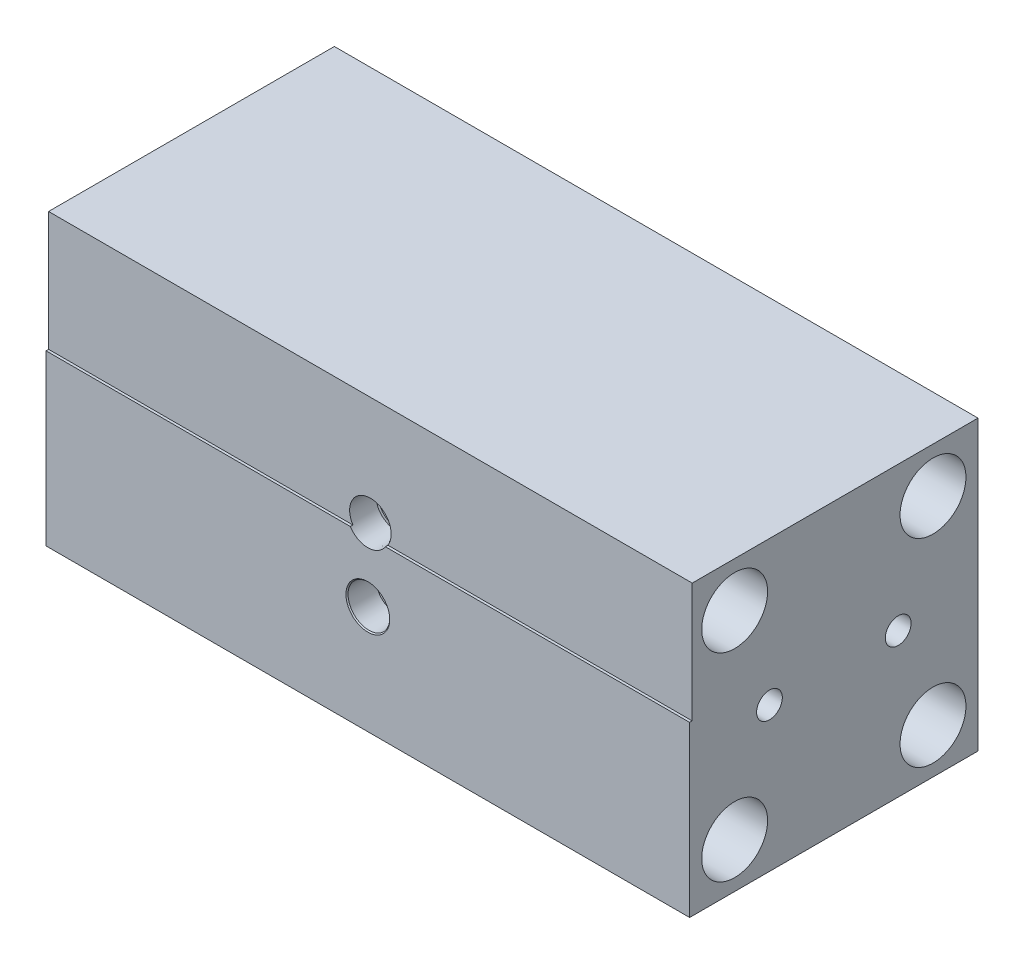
from build123d import *
from OCP.BRepFilletAPI import BRepFilletAPI_MakeChamfer

# Parameters (mm, degrees)
SKETCH1_W                         = 158.75
SKETCH1_H                         = 71.12
EXTRUDE1_DEPTH                    = 35.56
SKETCH18_W                        = 0.635
SKETCH18_H                        = 29.4386
CUT_EXTRUDE1_DEPTH                = 167.525042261
F_1_4_20_TAPPED_HOLE1_D           = 5.1054
F_1_4_20_TAPPED_HOLE1_DEPTH       = 14.3002
F_1_4_20_TAPPED_HOLE1_TIP         = 1.533816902
HOLE1_D                           = 6.35
HOLE1_DEPTH                       = 6.35
HOLE1_TIP                         = 1.907732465
F_1_8_NPT_TAPPED_HOLE1_AT_2_COUNT = 2
F_1_8_NPT_TAPPED_HOLE1_AT_2_PITCH = 17.78
F_1_4_20_TAPPED_HOLE2_D           = 5.1054
F_1_4_20_TAPPED_HOLE2_DEPTH       = 15.875
F_1_4_20_TAPPED_HOLE2_TIP         = 1.533816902
HOLE2_D                           = 6.35
HOLE2_DEPTH                       = 6.35
HOLE2_TIP                         = 1.907732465
SKETCH29_R                        = 8.128
SKETCH29_R_2                      = 3.175
CUT_EXTRUDE2_DEPTH                = 167.525042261
CHAMFER1_SIZE                     = 0.254
CHAMFER1_SIZE2                    = 0.261957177


with BuildPart() as part:
    # Sketch1 → Extrude1 (new, symmetric)
    with BuildSketch(Plane.XY):
        Rectangle(SKETCH1_W, SKETCH1_H)
    extrude(amount=EXTRUDE1_DEPTH, both=True)

    # Sketch18 → Cut-Extrude1 (cut, through all)
    with BuildSketch(Plane(origin=(79.375, 0, 0), x_dir=(0, 0, -1), z_dir=(1, 0, 0))):
        with Locations((-35.2425, 20.8407)):
            Rectangle(SKETCH18_W, SKETCH18_H)
    extrude(amount=-CUT_EXTRUDE1_DEPTH, mode=Mode.SUBTRACT)

    # 1_4-20 Tapped Hole1
    with Locations(Plane(origin=(0.538859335, -35.56, 6.981360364), x_dir=(1, 0, 0), z_dir=(0, -1, 0))):
        with Locations((-57.688859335, -6.981360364), (56.611140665, -6.981360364), (-19.588859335, -6.981360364), (18.511140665, -6.981360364)):
            Hole(F_1_4_20_TAPPED_HOLE1_D / 2, depth=F_1_4_20_TAPPED_HOLE1_DEPTH)
            with Locations((0, 0, -(F_1_4_20_TAPPED_HOLE1_DEPTH + F_1_4_20_TAPPED_HOLE1_TIP / 2))):  # 118° drill point
                Cone(0, F_1_4_20_TAPPED_HOLE1_D / 2, F_1_4_20_TAPPED_HOLE1_TIP, mode=Mode.SUBTRACT)

    # Hole1
    with Locations(Plane(origin=(-46.133592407, -35.56, -8.969374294), x_dir=(1, 0, 0), z_dir=(0, -1, 0))):
        with Locations((8.033592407, 8.969374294), (84.233592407, 8.969374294)):
            Hole(HOLE1_D / 2, depth=HOLE1_DEPTH)
            with Locations((0, 0, -(HOLE1_DEPTH + HOLE1_TIP / 2))):  # 118° drill point
                Cone(0, HOLE1_D / 2, HOLE1_TIP, mode=Mode.SUBTRACT)

    # Sketch23 → 1_8 NPT Tapped Hole1 (revolve, cut)
    with BuildSketch(Plane(origin=(0, -8.89, 35.56), x_dir=(0, -1, 0), z_dir=(1, 0, 0))):
        Polygon((0, 0), (0, 14.166668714), (4.2164, 11.6332), (4.2164, 6.9342), (4.936185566, 6.9342), (5.1438048, 0), align=None)
    f_1_8_npt_tapped_hole1 = revolve(axis=Axis((0, -8.89, 41.91), (0, 0, -1)), mode=Mode.SUBTRACT)

    # 1_8 NPT Tapped Hole1 at 2: 1_8 NPT Tapped Hole1 ×2
    with Locations(*[(0, i * F_1_8_NPT_TAPPED_HOLE1_AT_2_PITCH, 0) for i in range(1, F_1_8_NPT_TAPPED_HOLE1_AT_2_COUNT)]):
        add(f_1_8_npt_tapped_hole1, mode=Mode.SUBTRACT)

    # 1_4-20 Tapped Hole2
    with Locations(Plane(origin=(0, 0, -35.56), x_dir=(-1, 0, 0), z_dir=(0, 0, -1))):
        with Locations((-63.5, 10.16), (63.5, 10.16), (-63.5, -10.16), (63.5, -10.16)):
            Hole(F_1_4_20_TAPPED_HOLE2_D / 2, depth=F_1_4_20_TAPPED_HOLE2_DEPTH)
            with Locations((0, 0, -(F_1_4_20_TAPPED_HOLE2_DEPTH + F_1_4_20_TAPPED_HOLE2_TIP / 2))):  # 118° drill point
                Cone(0, F_1_4_20_TAPPED_HOLE2_D / 2, F_1_4_20_TAPPED_HOLE2_TIP, mode=Mode.SUBTRACT)

    # Hole2
    with Locations(Plane(origin=(0, 0, -35.56), x_dir=(-1, 0, 0), z_dir=(0, 0, -1))):
        with Locations((50.8, 10.16), (-50.8, -10.16)):
            Hole(HOLE2_D / 2, depth=HOLE2_DEPTH)
            with Locations((0, 0, -(HOLE2_DEPTH + HOLE2_TIP / 2))):  # 118° drill point
                Cone(0, HOLE2_D / 2, HOLE2_TIP, mode=Mode.SUBTRACT)

    # Sketch29 → Cut-Extrude2 (cut, through all)
    with BuildSketch(Plane(origin=(79.375, 0, 0), x_dir=(0, 0, -1), z_dir=(1, 0, 0))):
        with Locations((-24.4602, 24.4602)):
            Circle(SKETCH29_R)
        with Locations((24.4602, 24.4602)):
            Circle(SKETCH29_R)
        with Locations((-24.4602, -24.4602)):
            Circle(SKETCH29_R)
        with Locations((24.4602, -24.4602)):
            Circle(SKETCH29_R)
        with Locations((-15.875, 0)):
            Circle(SKETCH29_R_2)
        with Locations((15.875, 0)):
            Circle(SKETCH29_R_2)
    extrude(amount=-CUT_EXTRUDE2_DEPTH, mode=Mode.SUBTRACT)

    # Chamfer1: one chamfer whose edges measure the first distance from different faces: ONE call of the kernel's chamfer builder (chamfer() names one face for all edges)
    chamfer1_edges_1 = [part.edges().sort_by_distance(p)[0] for p in [
        (21.6027, -35.56, 0),
        (-16.4973, -35.56, 0),
        (59.7027, -35.56, 0),
        (-54.5973, -35.56, 0),
        (41.275, -35.56, 0),
        (-34.925, -35.56, 0),
        (-66.0527, -10.16, -35.56),
        (60.9473, -10.16, -35.56),
        (-66.0527, 10.16, -35.56),
        (60.9473, 10.16, -35.56),
        (47.625, -10.16, -35.56),
        (-53.975, 10.16, -35.56),
    ]]
    chamfer1_edges_2 = [part.edges().sort_by_distance(p)[0] for p in [
        (0, -3.7461952, 35.56),
    ]]
    chamfer1_side_2 = [part.faces().sort_by_distance(p)[0] for p in [
        (0, -14.837881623, 35.56),
    ]]
    chamfer1 = BRepFilletAPI_MakeChamfer(part.part.solid().wrapped)
    for e in chamfer1_edges_1:
        chamfer1.Add(CHAMFER1_SIZE, e.wrapped)
    for e in chamfer1_edges_2:
        chamfer1.Add(CHAMFER1_SIZE, CHAMFER1_SIZE2, e.wrapped, chamfer1_side_2[0].wrapped)  # the first distance lies on this face
    add(Compound.cast(chamfer1.Shape()), mode=Mode.REPLACE)


solid = part.part
